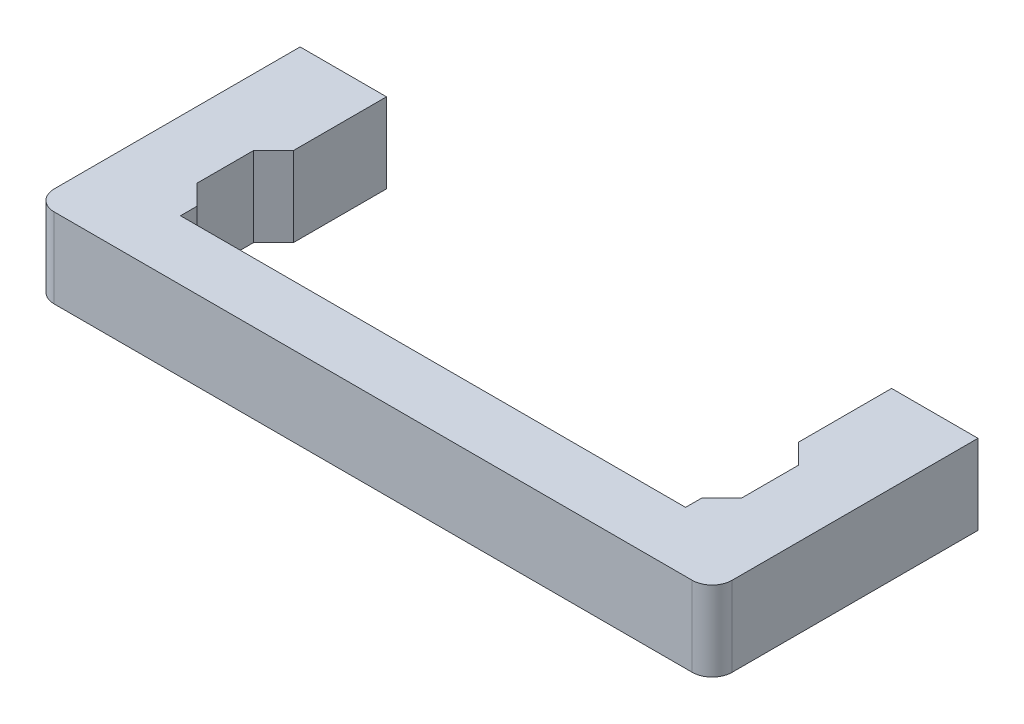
ISO-10303-21;
HEADER;
FILE_DESCRIPTION(('STEP AP214'),'2;1');
FILE_NAME('part.step','',(''),(''),'','','');
FILE_SCHEMA(('AUTOMOTIVE_DESIGN { 1 0 10303 214 1 1 1 1 }'));
ENDSEC;
DATA;
#1=APPLICATION_CONTEXT('core data for automotive mechanical design processes');
#2=APPLICATION_PROTOCOL_DEFINITION('international standard','automotive_design',2000,#1);
#3=PRODUCT_CONTEXT('',#1,'mechanical');
#4=PRODUCT('Part','Part','',(#3));
#5=PRODUCT_RELATED_PRODUCT_CATEGORY('part','',(#4));
#6=PRODUCT_DEFINITION_FORMATION('','',#4);
#7=PRODUCT_DEFINITION_CONTEXT('part definition',#1,'design');
#8=PRODUCT_DEFINITION('design','',#6,#7);
#9=PRODUCT_DEFINITION_SHAPE('','',#8);
#10=(LENGTH_UNIT() NAMED_UNIT(*) SI_UNIT(.MILLI.,.METRE.));
#11=(NAMED_UNIT(*) PLANE_ANGLE_UNIT() SI_UNIT($,.RADIAN.));
#12=(NAMED_UNIT(*) SI_UNIT($,.STERADIAN.) SOLID_ANGLE_UNIT());
#13=UNCERTAINTY_MEASURE_WITH_UNIT(LENGTH_MEASURE(1.E-05),#10,'distance_accuracy_value','');
#14=(GEOMETRIC_REPRESENTATION_CONTEXT(3) GLOBAL_UNCERTAINTY_ASSIGNED_CONTEXT((#13)) GLOBAL_UNIT_ASSIGNED_CONTEXT((#10,
#11,#12)) REPRESENTATION_CONTEXT('',''));
#15=CARTESIAN_POINT('',(0.,0.,0.));
#16=DIRECTION('',(0.,0.,1.));
#17=DIRECTION('',(1.,0.,0.));
#18=AXIS2_PLACEMENT_3D('',#15,#16,#17);
#19=CARTESIAN_POINT('',(44.,-6.,31.));
#20=DIRECTION('',(0.,0.,-1.));
#21=DIRECTION('',(0.,1.,0.));
#22=AXIS2_PLACEMENT_3D('',#19,#20,#21);
#23=PLANE('',#22);
#24=DIRECTION('',(-1.,0.,0.));
#25=VECTOR('',#24,1.);
#26=CARTESIAN_POINT('',(44.,6.,31.));
#27=LINE('',#26,#25);
#28=CARTESIAN_POINT('',(82.,6.,31.));
#29=VERTEX_POINT('',#28);
#30=CARTESIAN_POINT('',(6.,6.,31.));
#31=VERTEX_POINT('',#30);
#32=EDGE_CURVE('E136',#29,#31,#27,.T.);
#33=ORIENTED_EDGE('',*,*,#32,.F.);
#34=DIRECTION('',(0.,1.,0.));
#35=VECTOR('',#34,1.);
#36=CARTESIAN_POINT('',(82.,-6.,31.));
#37=LINE('',#36,#35);
#38=CARTESIAN_POINT('',(82.,-6.,31.));
#39=VERTEX_POINT('',#38);
#40=EDGE_CURVE('E139',#39,#29,#37,.T.);
#41=ORIENTED_EDGE('',*,*,#40,.F.);
#42=DIRECTION('',(-1.,0.,0.));
#43=VECTOR('',#42,1.);
#44=CARTESIAN_POINT('',(44.,-6.,31.));
#45=LINE('',#44,#43);
#46=CARTESIAN_POINT('',(6.,-6.,31.));
#47=VERTEX_POINT('',#46);
#48=EDGE_CURVE('E254',#39,#47,#45,.T.);
#49=ORIENTED_EDGE('',*,*,#48,.T.);
#50=DIRECTION('',(0.,1.,0.));
#51=VECTOR('',#50,1.);
#52=CARTESIAN_POINT('',(6.,-6.,31.));
#53=LINE('',#52,#51);
#54=EDGE_CURVE('E141',#47,#31,#53,.T.);
#55=ORIENTED_EDGE('',*,*,#54,.T.);
#56=EDGE_LOOP('',(#33,#41,#49,#55));
#57=FACE_BOUND('',#56,.T.);
#58=ADVANCED_FACE('F14',(#57),#23,.T.);
#59=CARTESIAN_POINT('',(44.,-6.,40.));
#60=DIRECTION('',(0.,0.,-1.));
#61=DIRECTION('',(0.,1.,0.));
#62=AXIS2_PLACEMENT_3D('',#59,#60,#61);
#63=PLANE('',#62);
#64=DIRECTION('',(0.,1.,0.));
#65=VECTOR('',#64,1.);
#66=CARTESIAN_POINT('',(-4.,-6.,40.));
#67=LINE('',#66,#65);
#68=CARTESIAN_POINT('',(-4.,-6.,40.));
#69=VERTEX_POINT('',#68);
#70=CARTESIAN_POINT('',(-4.,6.,40.));
#71=VERTEX_POINT('',#70);
#72=EDGE_CURVE('E9',#69,#71,#67,.T.);
#73=ORIENTED_EDGE('',*,*,#72,.F.);
#74=DIRECTION('',(-1.,0.,0.));
#75=VECTOR('',#74,1.);
#76=CARTESIAN_POINT('',(44.,-6.,40.));
#77=LINE('',#76,#75);
#78=CARTESIAN_POINT('',(92.,-6.,40.));
#79=VERTEX_POINT('',#78);
#80=EDGE_CURVE('E280',#79,#69,#77,.T.);
#81=ORIENTED_EDGE('',*,*,#80,.F.);
#82=DIRECTION('',(0.,1.,0.));
#83=VECTOR('',#82,1.);
#84=CARTESIAN_POINT('',(92.,-6.,40.));
#85=LINE('',#84,#83);
#86=CARTESIAN_POINT('',(92.,6.,40.));
#87=VERTEX_POINT('',#86);
#88=EDGE_CURVE('E223',#79,#87,#85,.T.);
#89=ORIENTED_EDGE('',*,*,#88,.T.);
#90=DIRECTION('',(-1.,0.,0.));
#91=VECTOR('',#90,1.);
#92=CARTESIAN_POINT('',(44.,6.,40.));
#93=LINE('',#92,#91);
#94=EDGE_CURVE('E252',#87,#71,#93,.T.);
#95=ORIENTED_EDGE('',*,*,#94,.T.);
#96=EDGE_LOOP('',(#73,#81,#89,#95));
#97=FACE_BOUND('',#96,.T.);
#98=ADVANCED_FACE('F16',(#97),#63,.F.);
#99=CARTESIAN_POINT('',(-4.,-6.,37.));
#100=DIRECTION('',(0.,1.,0.));
#101=DIRECTION('',(-1.,0.,0.));
#102=AXIS2_PLACEMENT_3D('',#99,#100,#101);
#103=CYLINDRICAL_SURFACE('',#102,3.);
#104=DIRECTION('',(0.,1.,0.));
#105=VECTOR('',#104,1.);
#106=CARTESIAN_POINT('',(-7.,-6.,37.));
#107=LINE('',#106,#105);
#108=CARTESIAN_POINT('',(-7.,-6.,37.));
#109=VERTEX_POINT('',#108);
#110=CARTESIAN_POINT('',(-7.,6.,37.));
#111=VERTEX_POINT('',#110);
#112=EDGE_CURVE('E22',#109,#111,#107,.T.);
#113=ORIENTED_EDGE('',*,*,#112,.F.);
#114=CARTESIAN_POINT('',(-4.,-6.,37.));
#115=DIRECTION('',(0.,-1.,0.));
#116=DIRECTION('',(1.,0.,0.));
#117=AXIS2_PLACEMENT_3D('',#114,#115,#116);
#118=CIRCLE('',#117,3.);
#119=EDGE_CURVE('E277',#69,#109,#118,.T.);
#120=ORIENTED_EDGE('',*,*,#119,.F.);
#121=ORIENTED_EDGE('',*,*,#72,.T.);
#122=CARTESIAN_POINT('',(-4.,6.,37.));
#123=DIRECTION('',(0.,-1.,0.));
#124=DIRECTION('',(1.,0.,0.));
#125=AXIS2_PLACEMENT_3D('',#122,#123,#124);
#126=CIRCLE('',#125,3.);
#127=EDGE_CURVE('E250',#71,#111,#126,.T.);
#128=ORIENTED_EDGE('',*,*,#127,.T.);
#129=EDGE_LOOP('',(#113,#120,#121,#128));
#130=FACE_BOUND('',#129,.T.);
#131=ADVANCED_FACE('F301',(#130),#103,.T.);
#132=CARTESIAN_POINT('',(-7.,-6.,37.));
#133=DIRECTION('',(1.,0.,0.));
#134=DIRECTION('',(0.,1.,0.));
#135=AXIS2_PLACEMENT_3D('',#132,#133,#134);
#136=PLANE('',#135);
#137=DIRECTION('',(0.,1.,0.));
#138=VECTOR('',#137,1.);
#139=CARTESIAN_POINT('',(-7.,-6.,0.));
#140=LINE('',#139,#138);
#141=CARTESIAN_POINT('',(-7.,-6.,0.));
#142=VERTEX_POINT('',#141);
#143=CARTESIAN_POINT('',(-7.,6.,0.));
#144=VERTEX_POINT('',#143);
#145=EDGE_CURVE('E294',#142,#144,#140,.T.);
#146=ORIENTED_EDGE('',*,*,#145,.F.);
#147=DIRECTION('',(0.,0.,-1.));
#148=VECTOR('',#147,1.);
#149=CARTESIAN_POINT('',(-7.,-6.,37.));
#150=LINE('',#149,#148);
#151=EDGE_CURVE('E274',#109,#142,#150,.T.);
#152=ORIENTED_EDGE('',*,*,#151,.F.);
#153=ORIENTED_EDGE('',*,*,#112,.T.);
#154=DIRECTION('',(0.,0.,-1.));
#155=VECTOR('',#154,1.);
#156=CARTESIAN_POINT('',(-7.,6.,37.));
#157=LINE('',#156,#155);
#158=EDGE_CURVE('E247',#111,#144,#157,.T.);
#159=ORIENTED_EDGE('',*,*,#158,.T.);
#160=EDGE_LOOP('',(#146,#152,#153,#159));
#161=FACE_BOUND('',#160,.T.);
#162=ADVANCED_FACE('F297',(#161),#136,.F.);
#163=CARTESIAN_POINT('',(-7.,-6.,0.));
#164=DIRECTION('',(0.,0.,1.));
#165=DIRECTION('',(0.,-1.,0.));
#166=AXIS2_PLACEMENT_3D('',#163,#164,#165);
#167=PLANE('',#166);
#168=CARTESIAN_POINT('',(0.,0.,0.));
#169=DIRECTION('',(0.,0.,-1.));
#170=DIRECTION('',(0.,1.,0.));
#171=AXIS2_PLACEMENT_3D('',#168,#169,#170);
#172=CIRCLE('',#171,2.5);
#173=CARTESIAN_POINT('',(0.,2.5,0.));
#174=VERTEX_POINT('',#173);
#175=EDGE_CURVE('E226',#174,#174,#172,.T.);
#176=ORIENTED_EDGE('',*,*,#175,.F.);
#177=EDGE_LOOP('',(#176));
#178=FACE_BOUND('',#177,.T.);
#179=DIRECTION('',(0.,1.,0.));
#180=VECTOR('',#179,1.);
#181=CARTESIAN_POINT('',(6.,-6.,0.));
#182=LINE('',#181,#180);
#183=CARTESIAN_POINT('',(6.,-6.,0.));
#184=VERTEX_POINT('',#183);
#185=CARTESIAN_POINT('',(6.,6.,0.));
#186=VERTEX_POINT('',#185);
#187=EDGE_CURVE('E292',#184,#186,#182,.T.);
#188=ORIENTED_EDGE('',*,*,#187,.F.);
#189=DIRECTION('',(1.,0.,0.));
#190=VECTOR('',#189,1.);
#191=CARTESIAN_POINT('',(-7.,-6.,0.));
#192=LINE('',#191,#190);
#193=EDGE_CURVE('E271',#142,#184,#192,.T.);
#194=ORIENTED_EDGE('',*,*,#193,.F.);
#195=ORIENTED_EDGE('',*,*,#145,.T.);
#196=DIRECTION('',(1.,0.,0.));
#197=VECTOR('',#196,1.);
#198=CARTESIAN_POINT('',(-7.,6.,0.));
#199=LINE('',#198,#197);
#200=EDGE_CURVE('E244',#144,#186,#199,.T.);
#201=ORIENTED_EDGE('',*,*,#200,.T.);
#202=EDGE_LOOP('',(#188,#194,#195,#201));
#203=FACE_BOUND('',#202,.T.);
#204=ADVANCED_FACE('F350',(#178,#203),#167,.F.);
#205=CARTESIAN_POINT('',(6.,-6.,0.));
#206=DIRECTION('',(-1.,0.,0.));
#207=DIRECTION('',(0.,0.,-1.));
#208=AXIS2_PLACEMENT_3D('',#205,#206,#207);
#209=PLANE('',#208);
#210=DIRECTION('',(0.,1.,0.));
#211=VECTOR('',#210,1.);
#212=CARTESIAN_POINT('',(6.,-6.,14.));
#213=LINE('',#212,#211);
#214=CARTESIAN_POINT('',(6.,-6.,14.));
#215=VERTEX_POINT('',#214);
#216=CARTESIAN_POINT('',(6.,6.,14.));
#217=VERTEX_POINT('',#216);
#218=EDGE_CURVE('E290',#215,#217,#213,.T.);
#219=ORIENTED_EDGE('',*,*,#218,.F.);
#220=DIRECTION('',(0.,0.,1.));
#221=VECTOR('',#220,1.);
#222=CARTESIAN_POINT('',(6.,-6.,0.));
#223=LINE('',#222,#221);
#224=EDGE_CURVE('E268',#184,#215,#223,.T.);
#225=ORIENTED_EDGE('',*,*,#224,.F.);
#226=ORIENTED_EDGE('',*,*,#187,.T.);
#227=DIRECTION('',(0.,0.,1.));
#228=VECTOR('',#227,1.);
#229=CARTESIAN_POINT('',(6.,6.,0.));
#230=LINE('',#229,#228);
#231=EDGE_CURVE('E241',#186,#217,#230,.T.);
#232=ORIENTED_EDGE('',*,*,#231,.T.);
#233=EDGE_LOOP('',(#219,#225,#226,#232));
#234=FACE_BOUND('',#233,.T.);
#235=ADVANCED_FACE('F348',(#234),#209,.F.);
#236=CARTESIAN_POINT('',(6.,-6.,14.));
#237=DIRECTION('',(-0.707106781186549,0.,-0.707106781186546));
#238=DIRECTION('',(0.707106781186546,0.,-0.707106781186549));
#239=AXIS2_PLACEMENT_3D('',#236,#237,#238);
#240=PLANE('',#239);
#241=DIRECTION('',(0.,1.,0.));
#242=VECTOR('',#241,1.);
#243=CARTESIAN_POINT('',(3.,-6.,17.));
#244=LINE('',#243,#242);
#245=CARTESIAN_POINT('',(3.,-6.,17.));
#246=VERTEX_POINT('',#245);
#247=CARTESIAN_POINT('',(3.,6.,17.));
#248=VERTEX_POINT('',#247);
#249=EDGE_CURVE('E288',#246,#248,#244,.T.);
#250=ORIENTED_EDGE('',*,*,#249,.F.);
#251=DIRECTION('',(-0.707106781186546,0.,0.707106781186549));
#252=VECTOR('',#251,1.);
#253=CARTESIAN_POINT('',(6.,-6.,14.));
#254=LINE('',#253,#252);
#255=EDGE_CURVE('E265',#215,#246,#254,.T.);
#256=ORIENTED_EDGE('',*,*,#255,.F.);
#257=ORIENTED_EDGE('',*,*,#218,.T.);
#258=DIRECTION('',(-0.707106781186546,0.,0.707106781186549));
#259=VECTOR('',#258,1.);
#260=CARTESIAN_POINT('',(6.,6.,14.));
#261=LINE('',#260,#259);
#262=EDGE_CURVE('E238',#217,#248,#261,.T.);
#263=ORIENTED_EDGE('',*,*,#262,.T.);
#264=EDGE_LOOP('',(#250,#256,#257,#263));
#265=FACE_BOUND('',#264,.T.);
#266=ADVANCED_FACE('F344',(#265),#240,.F.);
#267=CARTESIAN_POINT('',(3.,-6.,25.5));
#268=DIRECTION('',(1.,0.,0.));
#269=DIRECTION('',(0.,0.,1.));
#270=AXIS2_PLACEMENT_3D('',#267,#268,#269);
#271=PLANE('',#270);
#272=DIRECTION('',(0.,1.,0.));
#273=VECTOR('',#272,1.);
#274=CARTESIAN_POINT('',(3.,-6.,25.5));
#275=LINE('',#274,#273);
#276=CARTESIAN_POINT('',(3.,-6.,25.5));
#277=VERTEX_POINT('',#276);
#278=CARTESIAN_POINT('',(3.,6.,25.5));
#279=VERTEX_POINT('',#278);
#280=EDGE_CURVE('E286',#277,#279,#275,.T.);
#281=ORIENTED_EDGE('',*,*,#280,.F.);
#282=DIRECTION('',(0.,0.,-1.));
#283=VECTOR('',#282,1.);
#284=CARTESIAN_POINT('',(3.,-6.,25.5));
#285=LINE('',#284,#283);
#286=EDGE_CURVE('E262',#277,#246,#285,.T.);
#287=ORIENTED_EDGE('',*,*,#286,.T.);
#288=ORIENTED_EDGE('',*,*,#249,.T.);
#289=DIRECTION('',(0.,0.,-1.));
#290=VECTOR('',#289,1.);
#291=CARTESIAN_POINT('',(3.,6.,25.5));
#292=LINE('',#291,#290);
#293=EDGE_CURVE('E235',#279,#248,#292,.T.);
#294=ORIENTED_EDGE('',*,*,#293,.F.);
#295=EDGE_LOOP('',(#281,#287,#288,#294));
#296=FACE_BOUND('',#295,.T.);
#297=ADVANCED_FACE('F341',(#296),#271,.T.);
#298=CARTESIAN_POINT('',(6.,-6.,28.5));
#299=DIRECTION('',(0.707106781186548,0.,-0.707106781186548));
#300=DIRECTION('',(0.707106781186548,0.,0.707106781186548));
#301=AXIS2_PLACEMENT_3D('',#298,#299,#300);
#302=PLANE('',#301);
#303=DIRECTION('',(0.,1.,0.));
#304=VECTOR('',#303,1.);
#305=CARTESIAN_POINT('',(6.,-6.,28.5));
#306=LINE('',#305,#304);
#307=CARTESIAN_POINT('',(6.,-6.,28.5));
#308=VERTEX_POINT('',#307);
#309=CARTESIAN_POINT('',(6.,6.,28.5));
#310=VERTEX_POINT('',#309);
#311=EDGE_CURVE('E284',#308,#310,#306,.T.);
#312=ORIENTED_EDGE('',*,*,#311,.F.);
#313=DIRECTION('',(-0.707106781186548,0.,-0.707106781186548));
#314=VECTOR('',#313,1.);
#315=CARTESIAN_POINT('',(6.,-6.,28.5));
#316=LINE('',#315,#314);
#317=EDGE_CURVE('E259',#308,#277,#316,.T.);
#318=ORIENTED_EDGE('',*,*,#317,.T.);
#319=ORIENTED_EDGE('',*,*,#280,.T.);
#320=DIRECTION('',(-0.707106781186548,0.,-0.707106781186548));
#321=VECTOR('',#320,1.);
#322=CARTESIAN_POINT('',(6.,6.,28.5));
#323=LINE('',#322,#321);
#324=EDGE_CURVE('E232',#310,#279,#323,.T.);
#325=ORIENTED_EDGE('',*,*,#324,.F.);
#326=EDGE_LOOP('',(#312,#318,#319,#325));
#327=FACE_BOUND('',#326,.T.);
#328=ADVANCED_FACE('F339',(#327),#302,.T.);
#329=CARTESIAN_POINT('',(6.,-6.,28.5));
#330=DIRECTION('',(-1.,0.,0.));
#331=DIRECTION('',(0.,0.,-1.));
#332=AXIS2_PLACEMENT_3D('',#329,#330,#331);
#333=PLANE('',#332);
#334=DIRECTION('',(0.,0.,1.));
#335=VECTOR('',#334,1.);
#336=CARTESIAN_POINT('',(6.,-6.,28.5));
#337=LINE('',#336,#335);
#338=EDGE_CURVE('E256',#308,#47,#337,.T.);
#339=ORIENTED_EDGE('',*,*,#338,.F.);
#340=ORIENTED_EDGE('',*,*,#311,.T.);
#341=DIRECTION('',(0.,0.,1.));
#342=VECTOR('',#341,1.);
#343=CARTESIAN_POINT('',(6.,6.,28.5));
#344=LINE('',#343,#342);
#345=EDGE_CURVE('E146',#310,#31,#344,.T.);
#346=ORIENTED_EDGE('',*,*,#345,.T.);
#347=ORIENTED_EDGE('',*,*,#54,.F.);
#348=EDGE_LOOP('',(#339,#340,#346,#347));
#349=FACE_BOUND('',#348,.T.);
#350=ADVANCED_FACE('F335',(#349),#333,.F.);
#351=CARTESIAN_POINT('',(-4.,-6.,37.));
#352=DIRECTION('',(0.,-1.,0.));
#353=DIRECTION('',(1.,0.,0.));
#354=AXIS2_PLACEMENT_3D('',#351,#352,#353);
#355=PLANE('',#354);
#356=ORIENTED_EDGE('',*,*,#48,.F.);
#357=DIRECTION('',(0.,0.,1.));
#358=VECTOR('',#357,1.);
#359=CARTESIAN_POINT('',(82.,-6.,28.5));
#360=LINE('',#359,#358);
#361=CARTESIAN_POINT('',(82.,-6.,28.5));
#362=VERTEX_POINT('',#361);
#363=EDGE_CURVE('E155',#362,#39,#360,.T.);
#364=ORIENTED_EDGE('',*,*,#363,.F.);
#365=DIRECTION('',(0.707106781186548,0.,-0.707106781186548));
#366=VECTOR('',#365,1.);
#367=CARTESIAN_POINT('',(82.,-6.,28.5));
#368=LINE('',#367,#366);
#369=CARTESIAN_POINT('',(85.,-6.,25.5));
#370=VERTEX_POINT('',#369);
#371=EDGE_CURVE('E190',#362,#370,#368,.T.);
#372=ORIENTED_EDGE('',*,*,#371,.T.);
#373=DIRECTION('',(0.,0.,-1.));
#374=VECTOR('',#373,1.);
#375=CARTESIAN_POINT('',(85.,-6.,25.5));
#376=LINE('',#375,#374);
#377=CARTESIAN_POINT('',(85.,-6.,17.));
#378=VERTEX_POINT('',#377);
#379=EDGE_CURVE('E193',#370,#378,#376,.T.);
#380=ORIENTED_EDGE('',*,*,#379,.T.);
#381=DIRECTION('',(0.707106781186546,0.,0.707106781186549));
#382=VECTOR('',#381,1.);
#383=CARTESIAN_POINT('',(82.,-6.,14.));
#384=LINE('',#383,#382);
#385=CARTESIAN_POINT('',(82.,-6.,14.));
#386=VERTEX_POINT('',#385);
#387=EDGE_CURVE('E196',#386,#378,#384,.T.);
#388=ORIENTED_EDGE('',*,*,#387,.F.);
#389=DIRECTION('',(0.,0.,1.));
#390=VECTOR('',#389,1.);
#391=CARTESIAN_POINT('',(82.,-6.,0.));
#392=LINE('',#391,#390);
#393=CARTESIAN_POINT('',(82.,-6.,0.));
#394=VERTEX_POINT('',#393);
#395=EDGE_CURVE('E199',#394,#386,#392,.T.);
#396=ORIENTED_EDGE('',*,*,#395,.F.);
#397=DIRECTION('',(-1.,0.,0.));
#398=VECTOR('',#397,1.);
#399=CARTESIAN_POINT('',(95.,-6.,0.));
#400=LINE('',#399,#398);
#401=CARTESIAN_POINT('',(95.,-6.,0.));
#402=VERTEX_POINT('',#401);
#403=EDGE_CURVE('E202',#402,#394,#400,.T.);
#404=ORIENTED_EDGE('',*,*,#403,.F.);
#405=DIRECTION('',(0.,0.,-1.));
#406=VECTOR('',#405,1.);
#407=CARTESIAN_POINT('',(95.,-6.,37.));
#408=LINE('',#407,#406);
#409=CARTESIAN_POINT('',(95.,-6.,37.));
#410=VERTEX_POINT('',#409);
#411=EDGE_CURVE('E205',#410,#402,#408,.T.);
#412=ORIENTED_EDGE('',*,*,#411,.F.);
#413=CARTESIAN_POINT('',(92.,-6.,37.));
#414=DIRECTION('',(0.,1.,0.));
#415=DIRECTION('',(-1.,0.,0.));
#416=AXIS2_PLACEMENT_3D('',#413,#414,#415);
#417=CIRCLE('',#416,3.);
#418=EDGE_CURVE('E157',#79,#410,#417,.T.);
#419=ORIENTED_EDGE('',*,*,#418,.F.);
#420=ORIENTED_EDGE('',*,*,#80,.T.);
#421=ORIENTED_EDGE('',*,*,#119,.T.);
#422=ORIENTED_EDGE('',*,*,#151,.T.);
#423=ORIENTED_EDGE('',*,*,#193,.T.);
#424=ORIENTED_EDGE('',*,*,#224,.T.);
#425=ORIENTED_EDGE('',*,*,#255,.T.);
#426=ORIENTED_EDGE('',*,*,#286,.F.);
#427=ORIENTED_EDGE('',*,*,#317,.F.);
#428=ORIENTED_EDGE('',*,*,#338,.T.);
#429=EDGE_LOOP('',(#356,#364,#372,#380,#388,#396,#404,#412,#419,#420,#421,#422,#423,#424,#425,
#426,#427,#428));
#430=FACE_BOUND('',#429,.T.);
#431=ADVANCED_FACE('F304',(#430),#355,.T.);
#432=CARTESIAN_POINT('',(-4.,6.,37.));
#433=DIRECTION('',(0.,-1.,0.));
#434=DIRECTION('',(1.,0.,0.));
#435=AXIS2_PLACEMENT_3D('',#432,#433,#434);
#436=PLANE('',#435);
#437=ORIENTED_EDGE('',*,*,#32,.T.);
#438=ORIENTED_EDGE('',*,*,#345,.F.);
#439=ORIENTED_EDGE('',*,*,#324,.T.);
#440=ORIENTED_EDGE('',*,*,#293,.T.);
#441=ORIENTED_EDGE('',*,*,#262,.F.);
#442=ORIENTED_EDGE('',*,*,#231,.F.);
#443=ORIENTED_EDGE('',*,*,#200,.F.);
#444=ORIENTED_EDGE('',*,*,#158,.F.);
#445=ORIENTED_EDGE('',*,*,#127,.F.);
#446=ORIENTED_EDGE('',*,*,#94,.F.);
#447=CARTESIAN_POINT('',(92.,6.,37.));
#448=DIRECTION('',(0.,1.,0.));
#449=DIRECTION('',(-1.,0.,0.));
#450=AXIS2_PLACEMENT_3D('',#447,#448,#449);
#451=CIRCLE('',#450,3.);
#452=CARTESIAN_POINT('',(95.,6.,37.));
#453=VERTEX_POINT('',#452);
#454=EDGE_CURVE('E186',#87,#453,#451,.T.);
#455=ORIENTED_EDGE('',*,*,#454,.T.);
#456=DIRECTION('',(0.,0.,-1.));
#457=VECTOR('',#456,1.);
#458=CARTESIAN_POINT('',(95.,6.,37.));
#459=LINE('',#458,#457);
#460=CARTESIAN_POINT('',(95.,6.,0.));
#461=VERTEX_POINT('',#460);
#462=EDGE_CURVE('E183',#453,#461,#459,.T.);
#463=ORIENTED_EDGE('',*,*,#462,.T.);
#464=DIRECTION('',(-1.,0.,0.));
#465=VECTOR('',#464,1.);
#466=CARTESIAN_POINT('',(95.,6.,0.));
#467=LINE('',#466,#465);
#468=CARTESIAN_POINT('',(82.,6.,0.));
#469=VERTEX_POINT('',#468);
#470=EDGE_CURVE('E180',#461,#469,#467,.T.);
#471=ORIENTED_EDGE('',*,*,#470,.T.);
#472=DIRECTION('',(0.,0.,1.));
#473=VECTOR('',#472,1.);
#474=CARTESIAN_POINT('',(82.,6.,0.));
#475=LINE('',#474,#473);
#476=CARTESIAN_POINT('',(82.,6.,14.));
#477=VERTEX_POINT('',#476);
#478=EDGE_CURVE('E177',#469,#477,#475,.T.);
#479=ORIENTED_EDGE('',*,*,#478,.T.);
#480=DIRECTION('',(0.707106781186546,0.,0.707106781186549));
#481=VECTOR('',#480,1.);
#482=CARTESIAN_POINT('',(82.,6.,14.));
#483=LINE('',#482,#481);
#484=CARTESIAN_POINT('',(85.,6.,17.));
#485=VERTEX_POINT('',#484);
#486=EDGE_CURVE('E174',#477,#485,#483,.T.);
#487=ORIENTED_EDGE('',*,*,#486,.T.);
#488=DIRECTION('',(0.,0.,-1.));
#489=VECTOR('',#488,1.);
#490=CARTESIAN_POINT('',(85.,6.,25.5));
#491=LINE('',#490,#489);
#492=CARTESIAN_POINT('',(85.,6.,25.5));
#493=VERTEX_POINT('',#492);
#494=EDGE_CURVE('E165',#493,#485,#491,.T.);
#495=ORIENTED_EDGE('',*,*,#494,.F.);
#496=DIRECTION('',(0.707106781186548,0.,-0.707106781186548));
#497=VECTOR('',#496,1.);
#498=CARTESIAN_POINT('',(82.,6.,28.5));
#499=LINE('',#498,#497);
#500=CARTESIAN_POINT('',(82.,6.,28.5));
#501=VERTEX_POINT('',#500);
#502=EDGE_CURVE('E162',#501,#493,#499,.T.);
#503=ORIENTED_EDGE('',*,*,#502,.F.);
#504=DIRECTION('',(0.,0.,1.));
#505=VECTOR('',#504,1.);
#506=CARTESIAN_POINT('',(82.,6.,28.5));
#507=LINE('',#506,#505);
#508=EDGE_CURVE('E152',#501,#29,#507,.T.);
#509=ORIENTED_EDGE('',*,*,#508,.T.);
#510=EDGE_LOOP('',(#437,#438,#439,#440,#441,#442,#443,#444,#445,#446,#455,#463,#471,#479,#487,
#495,#503,#509));
#511=FACE_BOUND('',#510,.T.);
#512=ADVANCED_FACE('F159',(#511),#436,.F.);
#513=CARTESIAN_POINT('',(0.,0.,10.));
#514=DIRECTION('',(0.,0.,-1.));
#515=DIRECTION('',(0.,1.,0.));
#516=AXIS2_PLACEMENT_3D('',#513,#514,#515);
#517=CYLINDRICAL_SURFACE('',#516,2.5);
#518=CARTESIAN_POINT('',(0.,0.,10.));
#519=DIRECTION('',(0.,0.,-1.));
#520=DIRECTION('',(0.,1.,0.));
#521=AXIS2_PLACEMENT_3D('',#518,#519,#520);
#522=CIRCLE('',#521,2.5);
#523=CARTESIAN_POINT('',(0.,2.5,10.));
#524=VERTEX_POINT('',#523);
#525=EDGE_CURVE('E147',#524,#524,#522,.T.);
#526=ORIENTED_EDGE('',*,*,#525,.F.);
#527=EDGE_LOOP('',(#526));
#528=FACE_BOUND('',#527,.T.);
#529=ORIENTED_EDGE('',*,*,#175,.T.);
#530=EDGE_LOOP('',(#529));
#531=FACE_BOUND('',#530,.T.);
#532=ADVANCED_FACE('F418',(#528,#531),#517,.F.);
#533=CARTESIAN_POINT('',(0.,0.,10.));
#534=DIRECTION('',(0.,0.,-1.));
#535=DIRECTION('',(0.,1.,0.));
#536=AXIS2_PLACEMENT_3D('',#533,#534,#535);
#537=PLANE('',#536);
#538=ORIENTED_EDGE('',*,*,#525,.T.);
#539=EDGE_LOOP('',(#538));
#540=FACE_BOUND('',#539,.T.);
#541=ADVANCED_FACE('F419',(#540),#537,.T.);
#542=CARTESIAN_POINT('',(92.,-6.,37.));
#543=DIRECTION('',(0.,1.,0.));
#544=DIRECTION('',(1.,0.,0.));
#545=AXIS2_PLACEMENT_3D('',#542,#543,#544);
#546=CYLINDRICAL_SURFACE('',#545,3.);
#547=DIRECTION('',(0.,1.,0.));
#548=VECTOR('',#547,1.);
#549=CARTESIAN_POINT('',(95.,-6.,37.));
#550=LINE('',#549,#548);
#551=EDGE_CURVE('E221',#410,#453,#550,.T.);
#552=ORIENTED_EDGE('',*,*,#551,.T.);
#553=ORIENTED_EDGE('',*,*,#454,.F.);
#554=ORIENTED_EDGE('',*,*,#88,.F.);
#555=ORIENTED_EDGE('',*,*,#418,.T.);
#556=EDGE_LOOP('',(#552,#553,#554,#555));
#557=FACE_BOUND('',#556,.T.);
#558=ADVANCED_FACE('F309',(#557),#546,.T.);
#559=CARTESIAN_POINT('',(95.,-6.,37.));
#560=DIRECTION('',(-1.,0.,0.));
#561=DIRECTION('',(0.,1.,0.));
#562=AXIS2_PLACEMENT_3D('',#559,#560,#561);
#563=PLANE('',#562);
#564=DIRECTION('',(0.,1.,0.));
#565=VECTOR('',#564,1.);
#566=CARTESIAN_POINT('',(95.,-6.,0.));
#567=LINE('',#566,#565);
#568=EDGE_CURVE('E219',#402,#461,#567,.T.);
#569=ORIENTED_EDGE('',*,*,#568,.T.);
#570=ORIENTED_EDGE('',*,*,#462,.F.);
#571=ORIENTED_EDGE('',*,*,#551,.F.);
#572=ORIENTED_EDGE('',*,*,#411,.T.);
#573=EDGE_LOOP('',(#569,#570,#571,#572));
#574=FACE_BOUND('',#573,.T.);
#575=ADVANCED_FACE('F313',(#574),#563,.F.);
#576=CARTESIAN_POINT('',(95.,-6.,0.));
#577=DIRECTION('',(0.,0.,1.));
#578=DIRECTION('',(0.,-1.,0.));
#579=AXIS2_PLACEMENT_3D('',#576,#577,#578);
#580=PLANE('',#579);
#581=CARTESIAN_POINT('',(88.,0.,0.));
#582=DIRECTION('',(0.,0.,1.));
#583=DIRECTION('',(0.,1.,0.));
#584=AXIS2_PLACEMENT_3D('',#581,#582,#583);
#585=CIRCLE('',#584,2.5);
#586=CARTESIAN_POINT('',(88.,2.5,0.));
#587=VERTEX_POINT('',#586);
#588=EDGE_CURVE('E168',#587,#587,#585,.T.);
#589=ORIENTED_EDGE('',*,*,#588,.T.);
#590=EDGE_LOOP('',(#589));
#591=FACE_BOUND('',#590,.T.);
#592=DIRECTION('',(0.,1.,0.));
#593=VECTOR('',#592,1.);
#594=CARTESIAN_POINT('',(82.,-6.,0.));
#595=LINE('',#594,#593);
#596=EDGE_CURVE('E217',#394,#469,#595,.T.);
#597=ORIENTED_EDGE('',*,*,#596,.T.);
#598=ORIENTED_EDGE('',*,*,#470,.F.);
#599=ORIENTED_EDGE('',*,*,#568,.F.);
#600=ORIENTED_EDGE('',*,*,#403,.T.);
#601=EDGE_LOOP('',(#597,#598,#599,#600));
#602=FACE_BOUND('',#601,.T.);
#603=ADVANCED_FACE('F316',(#591,#602),#580,.F.);
#604=CARTESIAN_POINT('',(82.,-6.,0.));
#605=DIRECTION('',(1.,0.,0.));
#606=DIRECTION('',(0.,0.,-1.));
#607=AXIS2_PLACEMENT_3D('',#604,#605,#606);
#608=PLANE('',#607);
#609=DIRECTION('',(0.,1.,0.));
#610=VECTOR('',#609,1.);
#611=CARTESIAN_POINT('',(82.,-6.,14.));
#612=LINE('',#611,#610);
#613=EDGE_CURVE('E215',#386,#477,#612,.T.);
#614=ORIENTED_EDGE('',*,*,#613,.T.);
#615=ORIENTED_EDGE('',*,*,#478,.F.);
#616=ORIENTED_EDGE('',*,*,#596,.F.);
#617=ORIENTED_EDGE('',*,*,#395,.T.);
#618=EDGE_LOOP('',(#614,#615,#616,#617));
#619=FACE_BOUND('',#618,.T.);
#620=ADVANCED_FACE('F320',(#619),#608,.F.);
#621=CARTESIAN_POINT('',(82.,-6.,14.));
#622=DIRECTION('',(0.707106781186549,0.,-0.707106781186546));
#623=DIRECTION('',(-0.707106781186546,0.,-0.707106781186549));
#624=AXIS2_PLACEMENT_3D('',#621,#622,#623);
#625=PLANE('',#624);
#626=DIRECTION('',(0.,1.,0.));
#627=VECTOR('',#626,1.);
#628=CARTESIAN_POINT('',(85.,-6.,17.));
#629=LINE('',#628,#627);
#630=EDGE_CURVE('E213',#378,#485,#629,.T.);
#631=ORIENTED_EDGE('',*,*,#630,.T.);
#632=ORIENTED_EDGE('',*,*,#486,.F.);
#633=ORIENTED_EDGE('',*,*,#613,.F.);
#634=ORIENTED_EDGE('',*,*,#387,.T.);
#635=EDGE_LOOP('',(#631,#632,#633,#634));
#636=FACE_BOUND('',#635,.T.);
#637=ADVANCED_FACE('F323',(#636),#625,.F.);
#638=CARTESIAN_POINT('',(85.,-6.,25.5));
#639=DIRECTION('',(-1.,0.,0.));
#640=DIRECTION('',(0.,0.,1.));
#641=AXIS2_PLACEMENT_3D('',#638,#639,#640);
#642=PLANE('',#641);
#643=DIRECTION('',(0.,1.,0.));
#644=VECTOR('',#643,1.);
#645=CARTESIAN_POINT('',(85.,-6.,25.5));
#646=LINE('',#645,#644);
#647=EDGE_CURVE('E211',#370,#493,#646,.T.);
#648=ORIENTED_EDGE('',*,*,#647,.T.);
#649=ORIENTED_EDGE('',*,*,#494,.T.);
#650=ORIENTED_EDGE('',*,*,#630,.F.);
#651=ORIENTED_EDGE('',*,*,#379,.F.);
#652=EDGE_LOOP('',(#648,#649,#650,#651));
#653=FACE_BOUND('',#652,.T.);
#654=ADVANCED_FACE('F327',(#653),#642,.T.);
#655=CARTESIAN_POINT('',(82.,-6.,28.5));
#656=DIRECTION('',(-0.707106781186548,0.,-0.707106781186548));
#657=DIRECTION('',(-0.707106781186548,0.,0.707106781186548));
#658=AXIS2_PLACEMENT_3D('',#655,#656,#657);
#659=PLANE('',#658);
#660=DIRECTION('',(0.,1.,0.));
#661=VECTOR('',#660,1.);
#662=CARTESIAN_POINT('',(82.,-6.,28.5));
#663=LINE('',#662,#661);
#664=EDGE_CURVE('E156',#362,#501,#663,.T.);
#665=ORIENTED_EDGE('',*,*,#664,.T.);
#666=ORIENTED_EDGE('',*,*,#502,.T.);
#667=ORIENTED_EDGE('',*,*,#647,.F.);
#668=ORIENTED_EDGE('',*,*,#371,.F.);
#669=EDGE_LOOP('',(#665,#666,#667,#668));
#670=FACE_BOUND('',#669,.T.);
#671=ADVANCED_FACE('F330',(#670),#659,.T.);
#672=CARTESIAN_POINT('',(82.,-6.,28.5));
#673=DIRECTION('',(1.,0.,0.));
#674=DIRECTION('',(0.,0.,-1.));
#675=AXIS2_PLACEMENT_3D('',#672,#673,#674);
#676=PLANE('',#675);
#677=ORIENTED_EDGE('',*,*,#363,.T.);
#678=ORIENTED_EDGE('',*,*,#40,.T.);
#679=ORIENTED_EDGE('',*,*,#508,.F.);
#680=ORIENTED_EDGE('',*,*,#664,.F.);
#681=EDGE_LOOP('',(#677,#678,#679,#680));
#682=FACE_BOUND('',#681,.T.);
#683=ADVANCED_FACE('F151',(#682),#676,.F.);
#684=CARTESIAN_POINT('',(88.,0.,10.));
#685=DIRECTION('',(0.,0.,-1.));
#686=DIRECTION('',(0.,1.,0.));
#687=AXIS2_PLACEMENT_3D('',#684,#685,#686);
#688=CYLINDRICAL_SURFACE('',#687,2.5);
#689=CARTESIAN_POINT('',(88.,0.,10.));
#690=DIRECTION('',(0.,0.,1.));
#691=DIRECTION('',(0.,1.,0.));
#692=AXIS2_PLACEMENT_3D('',#689,#690,#691);
#693=CIRCLE('',#692,2.5);
#694=CARTESIAN_POINT('',(88.,2.5,10.));
#695=VERTEX_POINT('',#694);
#696=EDGE_CURVE('E163',#695,#695,#693,.T.);
#697=ORIENTED_EDGE('',*,*,#696,.T.);
#698=EDGE_LOOP('',(#697));
#699=FACE_BOUND('',#698,.T.);
#700=ORIENTED_EDGE('',*,*,#588,.F.);
#701=EDGE_LOOP('',(#700));
#702=FACE_BOUND('',#701,.T.);
#703=ADVANCED_FACE('F492',(#699,#702),#688,.F.);
#704=CARTESIAN_POINT('',(88.,0.,10.));
#705=DIRECTION('',(0.,0.,-1.));
#706=DIRECTION('',(0.,1.,0.));
#707=AXIS2_PLACEMENT_3D('',#704,#705,#706);
#708=PLANE('',#707);
#709=ORIENTED_EDGE('',*,*,#696,.F.);
#710=EDGE_LOOP('',(#709));
#711=FACE_BOUND('',#710,.T.);
#712=ADVANCED_FACE('F494',(#711),#708,.T.);
#713=CLOSED_SHELL('',(#58,#98,#131,#162,#204,#235,#266,#297,#328,#350,#431,#512,#532,#541,#558,
#575,#603,#620,#637,#654,#671,#683,#703,#712));
#714=MANIFOLD_SOLID_BREP('B1',#713);
#715=ADVANCED_BREP_SHAPE_REPRESENTATION('',(#18,#714),#14);
#716=SHAPE_DEFINITION_REPRESENTATION(#9,#715);
ENDSEC;
END-ISO-10303-21;
